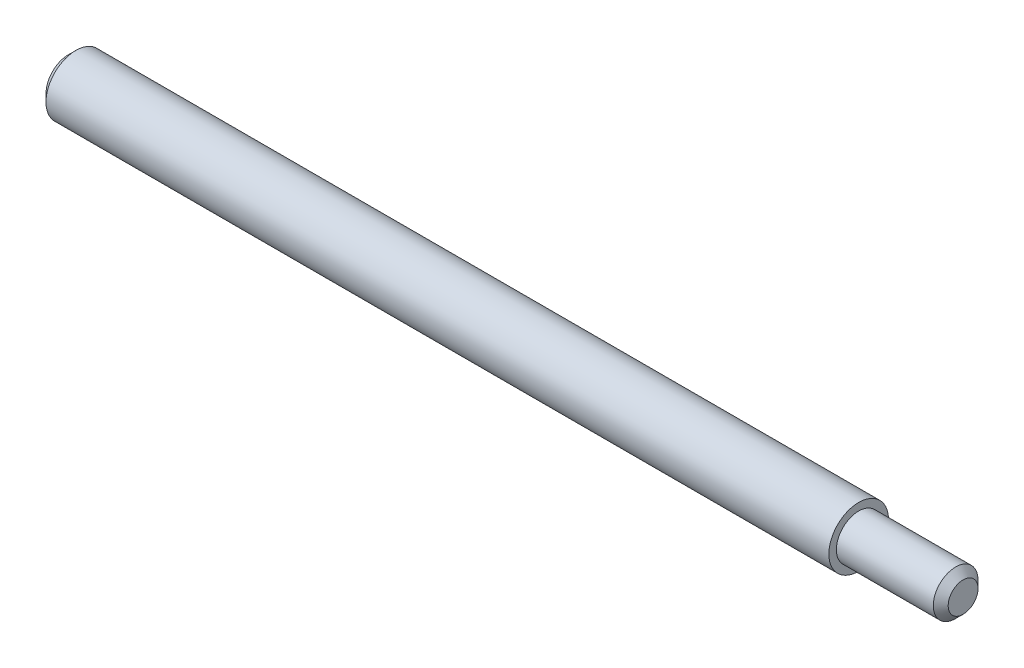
from build123d import *

# Parameters (mm, degrees)
CHANFREIN1_SIZE = 1


with BuildPart() as part:
    # Esquisse1 → R_volution1 (revolve)
    with BuildSketch(Plane.XY, mode=Mode.PRIVATE) as r_volution1_sk:
        Polygon((0, 0), (120, 0), (120, 2), (119, 3), (106, 3), (106, 4), (0, 4), align=None)
    revolve(r_volution1_sk.sketch.rotate(Axis((-45.474764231, 0, 0), (1, 0, 0)), 90), axis=Axis((-45.474764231, 0, 0), (1, 0, 0)))

    # Chanfrein1
    chanfrein1_edges = [part.edges().sort_by_distance(p)[0] for p in [
        (0, 0, -4),
    ]]
    chamfer(chanfrein1_edges, length=CHANFREIN1_SIZE)


solid = part.part
